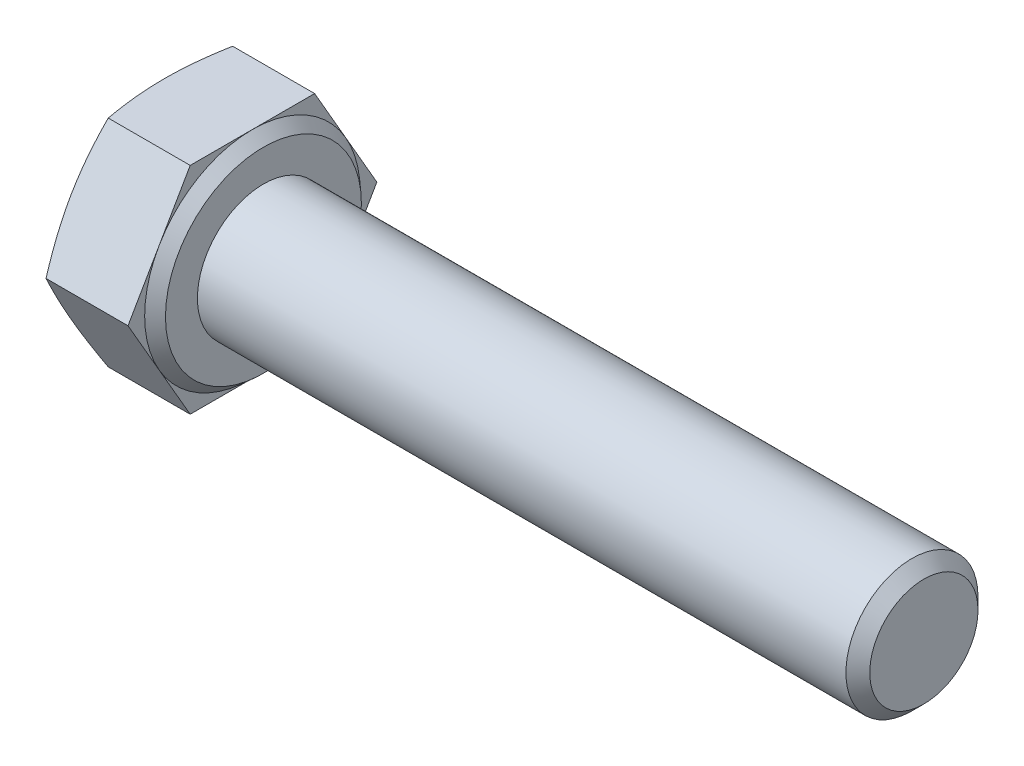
ISO-10303-21;
HEADER;
FILE_DESCRIPTION(('STEP AP214'),'2;1');
FILE_NAME('part.step','',(''),(''),'','','');
FILE_SCHEMA(('AUTOMOTIVE_DESIGN { 1 0 10303 214 1 1 1 1 }'));
ENDSEC;
DATA;
#1=APPLICATION_CONTEXT('core data for automotive mechanical design processes');
#2=APPLICATION_PROTOCOL_DEFINITION('international standard','automotive_design',2000,#1);
#3=PRODUCT_CONTEXT('',#1,'mechanical');
#4=PRODUCT('Part','Part','',(#3));
#5=PRODUCT_RELATED_PRODUCT_CATEGORY('part','',(#4));
#6=PRODUCT_DEFINITION_FORMATION('','',#4);
#7=PRODUCT_DEFINITION_CONTEXT('part definition',#1,'design');
#8=PRODUCT_DEFINITION('design','',#6,#7);
#9=PRODUCT_DEFINITION_SHAPE('','',#8);
#10=(LENGTH_UNIT() NAMED_UNIT(*) SI_UNIT(.MILLI.,.METRE.));
#11=(NAMED_UNIT(*) PLANE_ANGLE_UNIT() SI_UNIT($,.RADIAN.));
#12=(NAMED_UNIT(*) SI_UNIT($,.STERADIAN.) SOLID_ANGLE_UNIT());
#13=UNCERTAINTY_MEASURE_WITH_UNIT(LENGTH_MEASURE(1.E-05),#10,'distance_accuracy_value','');
#14=(GEOMETRIC_REPRESENTATION_CONTEXT(3) GLOBAL_UNCERTAINTY_ASSIGNED_CONTEXT((#13)) GLOBAL_UNIT_ASSIGNED_CONTEXT((#10,
#11,#12)) REPRESENTATION_CONTEXT('',''));
#15=CARTESIAN_POINT('',(0.,0.,0.));
#16=DIRECTION('',(0.,0.,1.));
#17=DIRECTION('',(1.,0.,0.));
#18=AXIS2_PLACEMENT_3D('',#15,#16,#17);
#19=CARTESIAN_POINT('',(4.5,0.,0.));
#20=DIRECTION('',(1.,0.,0.));
#21=DIRECTION('',(0.,0.,-1.));
#22=AXIS2_PLACEMENT_3D('',#19,#20,#21);
#23=PLANE('',#22);
#24=CARTESIAN_POINT('',(4.5,0.,0.));
#25=DIRECTION('',(-1.,0.,0.));
#26=DIRECTION('',(0.,0.,1.));
#27=AXIS2_PLACEMENT_3D('',#24,#25,#26);
#28=CIRCLE('',#27,4.45);
#29=CARTESIAN_POINT('',(4.5,0.,4.45));
#30=VERTEX_POINT('',#29);
#31=EDGE_CURVE('E149',#30,#30,#28,.T.);
#32=ORIENTED_EDGE('',*,*,#31,.F.);
#33=EDGE_LOOP('',(#32));
#34=FACE_BOUND('',#33,.T.);
#35=CARTESIAN_POINT('',(4.5,0.,0.));
#36=DIRECTION('',(1.,0.,0.));
#37=DIRECTION('',(0.,0.,-1.));
#38=AXIS2_PLACEMENT_3D('',#35,#36,#37);
#39=CIRCLE('',#38,3.);
#40=CARTESIAN_POINT('',(4.5,0.,-3.));
#41=VERTEX_POINT('',#40);
#42=EDGE_CURVE('E150',#41,#41,#39,.T.);
#43=ORIENTED_EDGE('',*,*,#42,.F.);
#44=EDGE_LOOP('',(#43));
#45=FACE_BOUND('',#44,.T.);
#46=ADVANCED_FACE('F43',(#34,#45),#23,.T.);
#47=CARTESIAN_POINT('',(4.,0.,-5.65225913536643));
#48=DIRECTION('',(1.,0.,0.));
#49=DIRECTION('',(0.,0.,-1.));
#50=AXIS2_PLACEMENT_3D('',#47,#48,#49);
#51=PLANE('',#50);
#52=DIRECTION('',(0.,-0.866025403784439,0.5));
#53=VECTOR('',#52,1.);
#54=CARTESIAN_POINT('',(4.,4.895,2.82612956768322));
#55=LINE('',#54,#53);
#56=CARTESIAN_POINT('',(4.,4.895,2.82612956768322));
#57=VERTEX_POINT('',#56);
#58=CARTESIAN_POINT('',(4.,2.4475,4.23919435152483));
#59=VERTEX_POINT('',#58);
#60=EDGE_CURVE('E147',#57,#59,#55,.T.);
#61=ORIENTED_EDGE('',*,*,#60,.T.);
#62=CARTESIAN_POINT('',(4.,0.,0.));
#63=DIRECTION('',(-1.,0.,0.));
#64=DIRECTION('',(0.,0.,1.));
#65=AXIS2_PLACEMENT_3D('',#62,#63,#64);
#66=CIRCLE('',#65,4.89499999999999);
#67=CARTESIAN_POINT('',(4.,4.89499999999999,0.));
#68=VERTEX_POINT('',#67);
#69=EDGE_CURVE('E59',#59,#68,#66,.T.);
#70=ORIENTED_EDGE('',*,*,#69,.T.);
#71=DIRECTION('',(0.,0.,1.));
#72=VECTOR('',#71,1.);
#73=CARTESIAN_POINT('',(4.,4.895,-2.82612956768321));
#74=LINE('',#73,#72);
#75=EDGE_CURVE('E141',#68,#57,#74,.T.);
#76=ORIENTED_EDGE('',*,*,#75,.T.);
#77=EDGE_LOOP('',(#61,#70,#76));
#78=FACE_BOUND('',#77,.T.);
#79=ADVANCED_FACE('F145',(#78),#51,.T.);
#80=CARTESIAN_POINT('',(4.,4.895,-2.82612956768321));
#81=VERTEX_POINT('',#80);
#82=EDGE_CURVE('E153',#81,#68,#74,.T.);
#83=ORIENTED_EDGE('',*,*,#82,.T.);
#84=CARTESIAN_POINT('',(4.,2.4475,-4.23919435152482));
#85=VERTEX_POINT('',#84);
#86=EDGE_CURVE('E134',#68,#85,#66,.T.);
#87=ORIENTED_EDGE('',*,*,#86,.T.);
#88=DIRECTION('',(0.,0.866025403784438,0.500000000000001));
#89=VECTOR('',#88,1.);
#90=CARTESIAN_POINT('',(4.,0.,-5.65225913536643));
#91=LINE('',#90,#89);
#92=EDGE_CURVE('E157',#85,#81,#91,.T.);
#93=ORIENTED_EDGE('',*,*,#92,.T.);
#94=EDGE_LOOP('',(#83,#87,#93));
#95=FACE_BOUND('',#94,.T.);
#96=ADVANCED_FACE('F158',(#95),#51,.T.);
#97=CARTESIAN_POINT('',(4.,0.,-5.65225913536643));
#98=VERTEX_POINT('',#97);
#99=EDGE_CURVE('E156',#98,#85,#91,.T.);
#100=ORIENTED_EDGE('',*,*,#99,.T.);
#101=CARTESIAN_POINT('',(4.,-2.4475,-4.23919435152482));
#102=VERTEX_POINT('',#101);
#103=EDGE_CURVE('E133',#85,#102,#66,.T.);
#104=ORIENTED_EDGE('',*,*,#103,.T.);
#105=DIRECTION('',(0.,0.866025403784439,-0.5));
#106=VECTOR('',#105,1.);
#107=CARTESIAN_POINT('',(4.,-4.89499999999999,-2.82612956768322));
#108=LINE('',#107,#106);
#109=EDGE_CURVE('E306',#102,#98,#108,.T.);
#110=ORIENTED_EDGE('',*,*,#109,.T.);
#111=EDGE_LOOP('',(#100,#104,#110));
#112=FACE_BOUND('',#111,.T.);
#113=ADVANCED_FACE('F474',(#112),#51,.T.);
#114=CARTESIAN_POINT('',(4.,-4.89499999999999,-2.82612956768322));
#115=VERTEX_POINT('',#114);
#116=EDGE_CURVE('E302',#115,#102,#108,.T.);
#117=ORIENTED_EDGE('',*,*,#116,.T.);
#118=CARTESIAN_POINT('',(4.,-4.89499999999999,0.));
#119=VERTEX_POINT('',#118);
#120=EDGE_CURVE('E373',#102,#119,#66,.T.);
#121=ORIENTED_EDGE('',*,*,#120,.T.);
#122=DIRECTION('',(0.,0.,-1.));
#123=VECTOR('',#122,1.);
#124=CARTESIAN_POINT('',(4.,-4.895,2.82612956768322));
#125=LINE('',#124,#123);
#126=EDGE_CURVE('E171',#119,#115,#125,.T.);
#127=ORIENTED_EDGE('',*,*,#126,.T.);
#128=EDGE_LOOP('',(#117,#121,#127));
#129=FACE_BOUND('',#128,.T.);
#130=ADVANCED_FACE('F465',(#129),#51,.T.);
#131=CARTESIAN_POINT('',(4.,-4.895,2.82612956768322));
#132=VERTEX_POINT('',#131);
#133=EDGE_CURVE('E175',#132,#119,#125,.T.);
#134=ORIENTED_EDGE('',*,*,#133,.T.);
#135=CARTESIAN_POINT('',(4.,-2.4475,4.23919435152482));
#136=VERTEX_POINT('',#135);
#137=EDGE_CURVE('E375',#119,#136,#66,.T.);
#138=ORIENTED_EDGE('',*,*,#137,.T.);
#139=DIRECTION('',(0.,-0.866025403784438,-0.5));
#140=VECTOR('',#139,1.);
#141=CARTESIAN_POINT('',(4.,0.,5.65225913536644));
#142=LINE('',#141,#140);
#143=EDGE_CURVE('E170',#136,#132,#142,.T.);
#144=ORIENTED_EDGE('',*,*,#143,.T.);
#145=EDGE_LOOP('',(#134,#138,#144));
#146=FACE_BOUND('',#145,.T.);
#147=ADVANCED_FACE('F290',(#146),#51,.T.);
#148=CARTESIAN_POINT('',(4.,0.,5.65225913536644));
#149=VERTEX_POINT('',#148);
#150=EDGE_CURVE('E166',#149,#136,#142,.T.);
#151=ORIENTED_EDGE('',*,*,#150,.T.);
#152=EDGE_CURVE('E146',#136,#59,#66,.T.);
#153=ORIENTED_EDGE('',*,*,#152,.T.);
#154=EDGE_CURVE('E162',#59,#149,#55,.T.);
#155=ORIENTED_EDGE('',*,*,#154,.T.);
#156=EDGE_LOOP('',(#151,#153,#155));
#157=FACE_BOUND('',#156,.T.);
#158=ADVANCED_FACE('F213',(#157),#51,.T.);
#159=CARTESIAN_POINT('',(4.,-4.89499999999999,-2.82612956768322));
#160=DIRECTION('',(0.,0.5,0.866025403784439));
#161=DIRECTION('',(0.,-0.866025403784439,0.5));
#162=AXIS2_PLACEMENT_3D('',#159,#160,#161);
#163=PLANE('',#162);
#164=CARTESIAN_POINT('',(0.275661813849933,0.000199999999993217,-5.65237460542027));
#165=CARTESIAN_POINT('',(0.233044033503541,-0.202529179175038,-5.53532885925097));
#166=CARTESIAN_POINT('',(0.194275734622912,-0.405926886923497,-5.41789713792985));
#167=CARTESIAN_POINT('',(0.126068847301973,-0.814044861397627,-5.18227011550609));
#168=CARTESIAN_POINT('',(0.0966375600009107,-1.01876603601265,-5.06407429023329));
#169=CARTESIAN_POINT('',(0.0490332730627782,-1.4272589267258,-4.828230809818));
#170=CARTESIAN_POINT('',(0.0307564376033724,-1.63102131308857,-4.71058854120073));
#171=CARTESIAN_POINT('',(0.00624205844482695,-2.03902260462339,-4.47502888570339));
#172=CARTESIAN_POINT('',(0.,-2.2432613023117,-4.35711161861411));
#173=CARTESIAN_POINT('',(0.,-2.6517386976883,-4.12127708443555));
#174=CARTESIAN_POINT('',(0.00624205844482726,-2.85597739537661,-4.00335981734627));
#175=CARTESIAN_POINT('',(0.0307564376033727,-3.26397868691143,-3.76780016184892));
#176=CARTESIAN_POINT('',(0.0490332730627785,-3.4677410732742,-3.65015789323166));
#177=CARTESIAN_POINT('',(0.0966375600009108,-3.87623396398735,-3.41431441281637));
#178=CARTESIAN_POINT('',(0.126068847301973,-4.08095513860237,-3.29611858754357));
#179=CARTESIAN_POINT('',(0.194275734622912,-4.4890731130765,-3.06049156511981));
#180=CARTESIAN_POINT('',(0.233044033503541,-4.69247082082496,-2.94305984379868));
#181=CARTESIAN_POINT('',(0.275661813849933,-4.89519999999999,-2.82601409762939));
#182=B_SPLINE_CURVE_WITH_KNOTS('',3,(#164,#165,#166,#167,#168,#169,#170,#171,#172,#173,#174,
#175,#176,#177,#178,#179,#180,#181),.UNSPECIFIED.,.F.,.F.,(4,2,2,2,2,2,2,2,4),(0.,
0.713891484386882,1.42833983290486,2.13603175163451,2.84345813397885,3.55088451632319,
4.25857643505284,4.97302478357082,5.6869162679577),.UNSPECIFIED.);
#183=CARTESIAN_POINT('',(0.275619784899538,0.,-5.65225913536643));
#184=VERTEX_POINT('',#183);
#185=CARTESIAN_POINT('',(0.,-2.4475,-4.23919435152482));
#186=VERTEX_POINT('',#185);
#187=EDGE_CURVE('E295',#184,#186,#182,.T.);
#188=ORIENTED_EDGE('',*,*,#187,.F.);
#189=DIRECTION('',(-1.,0.,0.));
#190=VECTOR('',#189,1.);
#191=CARTESIAN_POINT('',(4.,0.,-5.65225913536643));
#192=LINE('',#191,#190);
#193=EDGE_CURVE('E190',#98,#184,#192,.T.);
#194=ORIENTED_EDGE('',*,*,#193,.F.);
#195=ORIENTED_EDGE('',*,*,#109,.F.);
#196=ORIENTED_EDGE('',*,*,#116,.F.);
#197=DIRECTION('',(-1.,0.,0.));
#198=VECTOR('',#197,1.);
#199=CARTESIAN_POINT('',(4.,-4.89499999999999,-2.82612956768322));
#200=LINE('',#199,#198);
#201=CARTESIAN_POINT('',(0.275619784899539,-4.89499999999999,-2.82612956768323));
#202=VERTEX_POINT('',#201);
#203=EDGE_CURVE('E174',#115,#202,#200,.T.);
#204=ORIENTED_EDGE('',*,*,#203,.T.);
#205=EDGE_CURVE('E249',#186,#202,#182,.T.);
#206=ORIENTED_EDGE('',*,*,#205,.F.);
#207=EDGE_LOOP('',(#188,#194,#195,#196,#204,#206));
#208=FACE_BOUND('',#207,.T.);
#209=ADVANCED_FACE('F276',(#208),#163,.F.);
#210=CARTESIAN_POINT('',(4.,0.,-5.65225913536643));
#211=DIRECTION('',(0.,-0.500000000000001,0.866025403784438));
#212=DIRECTION('',(0.,-0.866025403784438,-0.500000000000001));
#213=AXIS2_PLACEMENT_3D('',#210,#211,#212);
#214=PLANE('',#213);
#215=CARTESIAN_POINT('',(0.275661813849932,4.8952,-2.82601409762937));
#216=CARTESIAN_POINT('',(0.23304403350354,4.69247082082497,-2.94305984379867));
#217=CARTESIAN_POINT('',(0.19427573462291,4.48907311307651,-3.06049156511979));
#218=CARTESIAN_POINT('',(0.126068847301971,4.08095513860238,-3.29611858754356));
#219=CARTESIAN_POINT('',(0.096637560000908,3.87623396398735,-3.41431441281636));
#220=CARTESIAN_POINT('',(0.0490332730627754,3.4677410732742,-3.65015789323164));
#221=CARTESIAN_POINT('',(0.0307564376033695,3.26397868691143,-3.76780016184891));
#222=CARTESIAN_POINT('',(0.00624205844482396,2.85597739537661,-4.00335981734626));
#223=CARTESIAN_POINT('',(0.,2.6517386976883,-4.12127708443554));
#224=CARTESIAN_POINT('',(0.,2.24326130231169,-4.3571116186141));
#225=CARTESIAN_POINT('',(0.00624205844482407,2.03902260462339,-4.47502888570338));
#226=CARTESIAN_POINT('',(0.0307564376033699,1.63102131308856,-4.71058854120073));
#227=CARTESIAN_POINT('',(0.0490332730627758,1.42725892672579,-4.828230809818));
#228=CARTESIAN_POINT('',(0.0966375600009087,1.01876603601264,-5.06407429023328));
#229=CARTESIAN_POINT('',(0.126068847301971,0.814044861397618,-5.18227011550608));
#230=CARTESIAN_POINT('',(0.194275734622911,0.405926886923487,-5.41789713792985));
#231=CARTESIAN_POINT('',(0.233044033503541,0.202529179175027,-5.53532885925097));
#232=CARTESIAN_POINT('',(0.275661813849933,-0.000200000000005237,-5.65237460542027));
#233=B_SPLINE_CURVE_WITH_KNOTS('',3,(#215,#216,#217,#218,#219,#220,#221,#222,#223,#224,#225,
#226,#227,#228,#229,#230,#231,#232),.UNSPECIFIED.,.F.,.F.,(4,2,2,2,2,2,2,2,4),(0.,
0.713891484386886,1.42833983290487,2.13603175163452,2.84345813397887,3.55088451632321,
4.25857643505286,4.97302478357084,5.68691626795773),.UNSPECIFIED.);
#234=CARTESIAN_POINT('',(0.275619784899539,4.895,-2.82612956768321));
#235=VERTEX_POINT('',#234);
#236=CARTESIAN_POINT('',(0.,2.4475,-4.23919435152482));
#237=VERTEX_POINT('',#236);
#238=EDGE_CURVE('E268',#235,#237,#233,.T.);
#239=ORIENTED_EDGE('',*,*,#238,.F.);
#240=DIRECTION('',(-1.,0.,0.));
#241=VECTOR('',#240,1.);
#242=CARTESIAN_POINT('',(4.,4.895,-2.82612956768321));
#243=LINE('',#242,#241);
#244=EDGE_CURVE('E184',#81,#235,#243,.T.);
#245=ORIENTED_EDGE('',*,*,#244,.F.);
#246=ORIENTED_EDGE('',*,*,#92,.F.);
#247=ORIENTED_EDGE('',*,*,#99,.F.);
#248=ORIENTED_EDGE('',*,*,#193,.T.);
#249=EDGE_CURVE('E265',#237,#184,#233,.T.);
#250=ORIENTED_EDGE('',*,*,#249,.F.);
#251=EDGE_LOOP('',(#239,#245,#246,#247,#248,#250));
#252=FACE_BOUND('',#251,.T.);
#253=ADVANCED_FACE('F277',(#252),#214,.F.);
#254=CARTESIAN_POINT('',(4.,4.895,-2.82612956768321));
#255=DIRECTION('',(0.,-1.,0.));
#256=DIRECTION('',(0.,0.,-1.));
#257=AXIS2_PLACEMENT_3D('',#254,#255,#256);
#258=PLANE('',#257);
#259=CARTESIAN_POINT('',(1.47280282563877,4.895,-7.48259735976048));
#260=CARTESIAN_POINT('',(1.4053660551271,4.895,-7.26112985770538));
#261=CARTESIAN_POINT('',(1.33871618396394,4.895,-7.03941829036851));
#262=CARTESIAN_POINT('',(1.20742555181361,4.895,-6.59538277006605));
#263=CARTESIAN_POINT('',(1.14278494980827,4.895,-6.37305877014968));
#264=CARTESIAN_POINT('',(1.01584063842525,4.895,-5.9272935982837));
#265=CARTESIAN_POINT('',(0.953541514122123,4.895,-5.70385111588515));
#266=CARTESIAN_POINT('',(0.832009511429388,4.895,-5.25613497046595));
#267=CARTESIAN_POINT('',(0.772776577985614,4.895,-5.03186132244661));
#268=CARTESIAN_POINT('',(0.658841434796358,4.895,-4.58509839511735));
#269=CARTESIAN_POINT('',(0.604092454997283,4.895,-4.36262110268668));
#270=CARTESIAN_POINT('',(0.499258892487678,4.895,-3.91657221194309));
#271=CARTESIAN_POINT('',(0.449174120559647,4.895,-3.69300065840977));
#272=CARTESIAN_POINT('',(0.354831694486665,4.895,-3.24469411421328));
#273=CARTESIAN_POINT('',(0.310572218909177,4.895,-3.01995951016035));
#274=CARTESIAN_POINT('',(0.229229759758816,4.895,-2.56918556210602));
#275=CARTESIAN_POINT('',(0.192146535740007,4.895,-2.34314626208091));
#276=CARTESIAN_POINT('',(0.130334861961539,4.895,-1.91521583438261));
#277=CARTESIAN_POINT('',(0.104687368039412,4.895,-1.71345870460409));
#278=CARTESIAN_POINT('',(0.0612722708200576,4.895,-1.30909131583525));
#279=CARTESIAN_POINT('',(0.0435044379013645,4.895,-1.10648108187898));
#280=CARTESIAN_POINT('',(0.0167043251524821,4.895,-0.700818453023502));
#281=CARTESIAN_POINT('',(0.00766586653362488,4.895,-0.497766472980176));
#282=CARTESIAN_POINT('',(-0.00121788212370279,4.895,-0.0914593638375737));
#283=CARTESIAN_POINT('',(-0.00106323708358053,4.895,0.111795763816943));
#284=CARTESIAN_POINT('',(0.00845489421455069,4.895,0.519118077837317));
#285=CARTESIAN_POINT('',(0.0178650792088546,4.895,0.723184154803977));
#286=CARTESIAN_POINT('',(0.0454612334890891,4.895,1.13071691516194));
#287=CARTESIAN_POINT('',(0.0636474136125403,4.895,1.33418358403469));
#288=CARTESIAN_POINT('',(0.107944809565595,4.895,1.74041706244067));
#289=CARTESIAN_POINT('',(0.134062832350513,4.895,1.94318311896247));
#290=CARTESIAN_POINT('',(0.193164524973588,4.895,2.34770083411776));
#291=CARTESIAN_POINT('',(0.226148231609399,4.895,2.54945248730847));
#292=CARTESIAN_POINT('',(0.299805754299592,4.895,2.96255825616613));
#293=CARTESIAN_POINT('',(0.340794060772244,4.895,3.17385579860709));
#294=CARTESIAN_POINT('',(0.428046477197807,4.895,3.59536569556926));
#295=CARTESIAN_POINT('',(0.474310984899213,4.895,3.80557796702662));
#296=CARTESIAN_POINT('',(0.571141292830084,4.895,4.22506166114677));
#297=CARTESIAN_POINT('',(0.621708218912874,4.895,4.43433282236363));
#298=CARTESIAN_POINT('',(0.726331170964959,4.895,4.85200390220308));
#299=CARTESIAN_POINT('',(0.780387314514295,4.895,5.06040379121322));
#300=CARTESIAN_POINT('',(0.946912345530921,4.895,5.68499348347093));
#301=CARTESIAN_POINT('',(1.06361407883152,4.895,6.10005298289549));
#302=CARTESIAN_POINT('',(1.3045083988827,4.895,6.92789191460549));
#303=CARTESIAN_POINT('',(1.42869979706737,4.895,7.34067169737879));
#304=CARTESIAN_POINT('',(1.68088123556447,4.895,8.16007873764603));
#305=CARTESIAN_POINT('',(1.80881421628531,4.895,8.5667236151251));
#306=CARTESIAN_POINT('',(2.06831294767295,4.895,9.37886971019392));
#307=CARTESIAN_POINT('',(2.19987887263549,4.895,9.78437087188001));
#308=CARTESIAN_POINT('',(2.46515556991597,4.895,10.5929650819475));
#309=CARTESIAN_POINT('',(2.59885630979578,4.895,10.9960614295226));
#310=CARTESIAN_POINT('',(2.86826241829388,4.895,11.8015473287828));
#311=CARTESIAN_POINT('',(3.00396762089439,4.895,12.2039369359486));
#312=CARTESIAN_POINT('',(3.14037395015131,4.895,12.6060852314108));
#313=B_SPLINE_CURVE_WITH_KNOTS('',3,(#259,#260,#261,#262,#263,#264,#265,#266,#267,#268,#269,
#270,#271,#272,#273,#274,#275,#276,#277,#278,#279,#280,#281,#282,#283,#284,#285,#286,#287,#288,
#289,#290,#291,#292,#293,#294,#295,#296,#297,#298,#299,#300,#301,#302,#303,#304,#305,#306,#307,
#308,#309,#310,#311,#312),.UNSPECIFIED.,.F.,.F.,(4,2,2,2,2,2,2,2,2,2,2,2,2,2,2,2,2,2,2,2,2,2,2,
2,2,2,4),(0.,0.69452644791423,1.38910771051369,2.08498488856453,2.78084956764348,
3.46815431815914,4.15543117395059,4.84249262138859,5.52953104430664,6.1395393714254,
6.74952992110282,7.35908839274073,7.96864255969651,8.58128808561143,9.19394833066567,
9.8071358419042,10.4203266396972,11.0659531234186,11.7116283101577,12.3574729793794,
13.0033394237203,14.2966762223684,15.5898083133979,16.8686670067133,18.1475871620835,
19.4216546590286,20.6956172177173),.UNSPECIFIED.);
#314=CARTESIAN_POINT('',(0.275619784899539,4.895,2.82612956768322));
#315=VERTEX_POINT('',#314);
#316=CARTESIAN_POINT('',(0.,4.895,0.));
#317=VERTEX_POINT('',#316);
#318=EDGE_CURVE('E69',#315,#317,#313,.F.);
#319=ORIENTED_EDGE('',*,*,#318,.F.);
#320=DIRECTION('',(-1.,0.,0.));
#321=VECTOR('',#320,1.);
#322=CARTESIAN_POINT('',(4.,4.895,2.82612956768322));
#323=LINE('',#322,#321);
#324=EDGE_CURVE('E159',#57,#315,#323,.T.);
#325=ORIENTED_EDGE('',*,*,#324,.F.);
#326=ORIENTED_EDGE('',*,*,#75,.F.);
#327=ORIENTED_EDGE('',*,*,#82,.F.);
#328=ORIENTED_EDGE('',*,*,#244,.T.);
#329=EDGE_CURVE('E267',#317,#235,#313,.F.);
#330=ORIENTED_EDGE('',*,*,#329,.F.);
#331=EDGE_LOOP('',(#319,#325,#326,#327,#328,#330));
#332=FACE_BOUND('',#331,.T.);
#333=ADVANCED_FACE('F151',(#332),#258,.F.);
#334=CARTESIAN_POINT('',(4.,4.895,2.82612956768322));
#335=DIRECTION('',(0.,-0.5,-0.866025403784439));
#336=DIRECTION('',(0.,0.866025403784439,-0.5));
#337=AXIS2_PLACEMENT_3D('',#334,#335,#336);
#338=PLANE('',#337);
#339=CARTESIAN_POINT('',(0.275661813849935,-0.000199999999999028,5.65237460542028));
#340=CARTESIAN_POINT('',(0.233044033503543,0.202529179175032,5.53532885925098));
#341=CARTESIAN_POINT('',(0.194275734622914,0.405926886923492,5.41789713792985));
#342=CARTESIAN_POINT('',(0.126068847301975,0.814044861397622,5.18227011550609));
#343=CARTESIAN_POINT('',(0.0966375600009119,1.01876603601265,5.06407429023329));
#344=CARTESIAN_POINT('',(0.0490332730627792,1.42725892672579,4.828230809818));
#345=CARTESIAN_POINT('',(0.0307564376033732,1.63102131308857,4.71058854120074));
#346=CARTESIAN_POINT('',(0.00624205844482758,2.03902260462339,4.47502888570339));
#347=CARTESIAN_POINT('',(0.,2.24326130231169,4.35711161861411));
#348=CARTESIAN_POINT('',(0.,2.6517386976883,4.12127708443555));
#349=CARTESIAN_POINT('',(0.00624205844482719,2.85597739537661,4.00335981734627));
#350=CARTESIAN_POINT('',(0.0307564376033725,3.26397868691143,3.76780016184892));
#351=CARTESIAN_POINT('',(0.0490332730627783,3.4677410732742,3.65015789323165));
#352=CARTESIAN_POINT('',(0.0966375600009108,3.87623396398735,3.41431441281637));
#353=CARTESIAN_POINT('',(0.126068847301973,4.08095513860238,3.29611858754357));
#354=CARTESIAN_POINT('',(0.194275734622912,4.4890731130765,3.06049156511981));
#355=CARTESIAN_POINT('',(0.233044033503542,4.69247082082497,2.94305984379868));
#356=CARTESIAN_POINT('',(0.275661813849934,4.8952,2.82601409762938));
#357=B_SPLINE_CURVE_WITH_KNOTS('',3,(#339,#340,#341,#342,#343,#344,#345,#346,#347,#348,#349,
#350,#351,#352,#353,#354,#355,#356),.UNSPECIFIED.,.F.,.F.,(4,2,2,2,2,2,2,2,4),(0.,
0.713891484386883,1.42833983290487,2.13603175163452,2.84345813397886,3.5508845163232,
4.25857643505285,4.97302478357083,5.68691626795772),.UNSPECIFIED.);
#358=CARTESIAN_POINT('',(0.27561978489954,0.,5.65225913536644));
#359=VERTEX_POINT('',#358);
#360=CARTESIAN_POINT('',(0.,2.4475,4.23919435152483));
#361=VERTEX_POINT('',#360);
#362=EDGE_CURVE('E257',#359,#361,#357,.T.);
#363=ORIENTED_EDGE('',*,*,#362,.F.);
#364=DIRECTION('',(-1.,0.,0.));
#365=VECTOR('',#364,1.);
#366=CARTESIAN_POINT('',(4.,0.,5.65225913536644));
#367=LINE('',#366,#365);
#368=EDGE_CURVE('E181',#149,#359,#367,.T.);
#369=ORIENTED_EDGE('',*,*,#368,.F.);
#370=ORIENTED_EDGE('',*,*,#154,.F.);
#371=ORIENTED_EDGE('',*,*,#60,.F.);
#372=ORIENTED_EDGE('',*,*,#324,.T.);
#373=EDGE_CURVE('E309',#361,#315,#357,.T.);
#374=ORIENTED_EDGE('',*,*,#373,.F.);
#375=EDGE_LOOP('',(#363,#369,#370,#371,#372,#374));
#376=FACE_BOUND('',#375,.T.);
#377=ADVANCED_FACE('F356',(#376),#338,.F.);
#378=CARTESIAN_POINT('',(4.,0.,5.65225913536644));
#379=DIRECTION('',(0.,0.5,-0.866025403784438));
#380=DIRECTION('',(0.,0.866025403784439,0.5));
#381=AXIS2_PLACEMENT_3D('',#378,#379,#380);
#382=PLANE('',#381);
#383=CARTESIAN_POINT('',(0.275661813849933,-4.8952,2.82601409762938));
#384=CARTESIAN_POINT('',(0.233044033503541,-4.69247082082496,2.94305984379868));
#385=CARTESIAN_POINT('',(0.194275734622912,-4.4890731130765,3.0604915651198));
#386=CARTESIAN_POINT('',(0.126068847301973,-4.08095513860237,3.29611858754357));
#387=CARTESIAN_POINT('',(0.0966375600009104,-3.87623396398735,3.41431441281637));
#388=CARTESIAN_POINT('',(0.049033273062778,-3.4677410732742,3.65015789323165));
#389=CARTESIAN_POINT('',(0.0307564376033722,-3.26397868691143,3.76780016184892));
#390=CARTESIAN_POINT('',(0.00624205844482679,-2.8559773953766,4.00335981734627));
#391=CARTESIAN_POINT('',(0.,-2.6517386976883,4.12127708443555));
#392=CARTESIAN_POINT('',(0.,-2.24326130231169,4.35711161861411));
#393=CARTESIAN_POINT('',(0.00624205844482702,-2.03902260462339,4.47502888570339));
#394=CARTESIAN_POINT('',(0.0307564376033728,-1.63102131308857,4.71058854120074));
#395=CARTESIAN_POINT('',(0.0490332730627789,-1.42725892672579,4.828230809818));
#396=CARTESIAN_POINT('',(0.0966375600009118,-1.01876603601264,5.06407429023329));
#397=CARTESIAN_POINT('',(0.126068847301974,-0.814044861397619,5.18227011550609));
#398=CARTESIAN_POINT('',(0.194275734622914,-0.405926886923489,5.41789713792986));
#399=CARTESIAN_POINT('',(0.233044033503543,-0.20252917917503,5.53532885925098));
#400=CARTESIAN_POINT('',(0.275661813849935,0.000200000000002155,5.65237460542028));
#401=B_SPLINE_CURVE_WITH_KNOTS('',3,(#383,#384,#385,#386,#387,#388,#389,#390,#391,#392,#393,
#394,#395,#396,#397,#398,#399,#400),.UNSPECIFIED.,.F.,.F.,(4,2,2,2,2,2,2,2,4),(0.,
0.713891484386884,1.42833983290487,2.13603175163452,2.84345813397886,3.5508845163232,
4.25857643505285,4.97302478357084,5.68691626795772),.UNSPECIFIED.);
#402=CARTESIAN_POINT('',(0.275619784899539,-4.895,2.82612956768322));
#403=VERTEX_POINT('',#402);
#404=CARTESIAN_POINT('',(0.,-2.4475,4.23919435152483));
#405=VERTEX_POINT('',#404);
#406=EDGE_CURVE('E245',#403,#405,#401,.T.);
#407=ORIENTED_EDGE('',*,*,#406,.F.);
#408=DIRECTION('',(-1.,0.,0.));
#409=VECTOR('',#408,1.);
#410=CARTESIAN_POINT('',(4.,-4.895,2.82612956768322));
#411=LINE('',#410,#409);
#412=EDGE_CURVE('E178',#132,#403,#411,.T.);
#413=ORIENTED_EDGE('',*,*,#412,.F.);
#414=ORIENTED_EDGE('',*,*,#143,.F.);
#415=ORIENTED_EDGE('',*,*,#150,.F.);
#416=ORIENTED_EDGE('',*,*,#368,.T.);
#417=EDGE_CURVE('E296',#405,#359,#401,.T.);
#418=ORIENTED_EDGE('',*,*,#417,.F.);
#419=EDGE_LOOP('',(#407,#413,#414,#415,#416,#418));
#420=FACE_BOUND('',#419,.T.);
#421=ADVANCED_FACE('F353',(#420),#382,.F.);
#422=CARTESIAN_POINT('',(4.,-4.895,2.82612956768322));
#423=DIRECTION('',(0.,1.,0.));
#424=DIRECTION('',(0.,0.,1.));
#425=AXIS2_PLACEMENT_3D('',#422,#423,#424);
#426=PLANE('',#425);
#427=CARTESIAN_POINT('',(1.47280309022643,-4.89499999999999,-7.48259822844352));
#428=CARTESIAN_POINT('',(1.40536630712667,-4.89499999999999,-7.26113069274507));
#429=CARTESIAN_POINT('',(1.33871642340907,-4.89499999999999,-7.03941909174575));
#430=CARTESIAN_POINT('',(1.2074257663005,-4.89499999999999,-6.5953835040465));
#431=CARTESIAN_POINT('',(1.14278515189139,-4.89499999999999,-6.37305947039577));
#432=CARTESIAN_POINT('',(1.01584081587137,-4.89499999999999,-5.927294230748));
#433=CARTESIAN_POINT('',(0.953541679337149,-4.89499999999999,-5.70385171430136));
#434=CARTESIAN_POINT('',(0.832009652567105,-4.89499999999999,-5.25613550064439));
#435=CARTESIAN_POINT('',(0.772776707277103,-4.89499999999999,-5.03186181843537));
#436=CARTESIAN_POINT('',(0.658841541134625,-4.89499999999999,-4.58509882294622));
#437=CARTESIAN_POINT('',(0.604092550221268,-4.89499999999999,-4.36262149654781));
#438=CARTESIAN_POINT('',(0.499258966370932,-4.89499999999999,-3.91657253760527));
#439=CARTESIAN_POINT('',(0.449174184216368,-4.89499999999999,-3.69300094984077));
#440=CARTESIAN_POINT('',(0.354831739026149,-4.89499999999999,-3.24469433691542));
#441=CARTESIAN_POINT('',(0.310572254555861,-4.89499999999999,-3.01995969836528));
#442=CARTESIAN_POINT('',(0.229229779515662,-4.89499999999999,-2.56918568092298));
#443=CARTESIAN_POINT('',(0.19214654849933,-4.89499999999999,-2.34314634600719));
#444=CARTESIAN_POINT('',(0.130334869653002,-4.89499999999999,-1.91521589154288));
#445=CARTESIAN_POINT('',(0.104687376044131,-4.89499999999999,-1.71345877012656));
#446=CARTESIAN_POINT('',(0.0612722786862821,-4.89499999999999,-1.30909139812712));
#447=CARTESIAN_POINT('',(0.0435044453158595,-4.89499999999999,-1.10648117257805));
#448=CARTESIAN_POINT('',(0.016704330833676,-4.89499999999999,-0.700818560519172));
#449=CARTESIAN_POINT('',(0.00766587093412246,-4.895,-0.497766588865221));
#450=CARTESIAN_POINT('',(-0.00121788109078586,-4.895,-0.091459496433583));
#451=CARTESIAN_POINT('',(-0.00106323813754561,-4.895,0.111795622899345));
#452=CARTESIAN_POINT('',(0.00845488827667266,-4.895,0.519117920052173));
#453=CARTESIAN_POINT('',(0.0178650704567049,-4.895,0.723183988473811));
#454=CARTESIAN_POINT('',(0.0454612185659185,-4.895,1.13071673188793));
#455=CARTESIAN_POINT('',(0.0636473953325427,-4.895,1.33418339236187));
#456=CARTESIAN_POINT('',(0.107944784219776,-4.895,1.7404168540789));
#457=CARTESIAN_POINT('',(0.134062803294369,-4.895,1.94318290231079));
#458=CARTESIAN_POINT('',(0.193164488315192,-4.895,2.34770060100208));
#459=CARTESIAN_POINT('',(0.22614819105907,-4.895,2.5494522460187));
#460=CARTESIAN_POINT('',(0.299805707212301,-4.895,2.96255800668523));
#461=CARTESIAN_POINT('',(0.340794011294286,-4.895,3.17385554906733));
#462=CARTESIAN_POINT('',(0.428046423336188,-4.895,3.59536544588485));
#463=CARTESIAN_POINT('',(0.474310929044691,-4.895,3.80557771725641));
#464=CARTESIAN_POINT('',(0.571141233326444,-4.895,4.22506141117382));
#465=CARTESIAN_POINT('',(0.621708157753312,-4.895,4.43433257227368));
#466=CARTESIAN_POINT('',(0.726331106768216,-4.895,4.85200365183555));
#467=CARTESIAN_POINT('',(0.78038724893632,-4.895,5.06040354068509));
#468=CARTESIAN_POINT('',(0.946912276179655,-4.895,5.68499323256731));
#469=CARTESIAN_POINT('',(1.06361400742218,-4.895,6.10005273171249));
#470=CARTESIAN_POINT('',(1.30450832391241,-4.895,6.92789166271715));
#471=CARTESIAN_POINT('',(1.42869972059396,-4.895,7.34067144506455));
#472=CARTESIAN_POINT('',(1.68088115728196,-4.895,8.16007848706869));
#473=CARTESIAN_POINT('',(1.80881413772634,-4.895,8.56672336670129));
#474=CARTESIAN_POINT('',(2.06831286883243,-4.895,9.3788694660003));
#475=CARTESIAN_POINT('',(2.19987879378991,-4.895,9.78437062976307));
#476=CARTESIAN_POINT('',(2.4651554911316,-4.895,10.5929648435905));
#477=CARTESIAN_POINT('',(2.59885623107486,-4.895,10.9960611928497));
#478=CARTESIAN_POINT('',(2.86826233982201,-4.895,11.801547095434));
#479=CARTESIAN_POINT('',(3.0039675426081,-4.895,12.2039367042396));
#480=CARTESIAN_POINT('',(3.14037387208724,-4.895,12.6060850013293));
#481=B_SPLINE_CURVE_WITH_KNOTS('',3,(#427,#428,#429,#430,#431,#432,#433,#434,#435,#436,#437,
#438,#439,#440,#441,#442,#443,#444,#445,#446,#447,#448,#449,#450,#451,#452,#453,#454,#455,#456,
#457,#458,#459,#460,#461,#462,#463,#464,#465,#466,#467,#468,#469,#470,#471,#472,#473,#474,#475,
#476,#477,#478,#479,#480),.UNSPECIFIED.,.F.,.F.,(4,2,2,2,2,2,2,2,2,2,2,2,2,2,2,2,2,2,2,2,2,2,2,
2,2,2,4),(0.,0.694526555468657,1.38910792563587,2.08498521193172,2.78084999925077,
3.46815485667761,4.15543181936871,4.84249337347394,5.52953190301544,6.13954020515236,
6.7495307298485,7.35908917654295,7.96864331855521,8.5812888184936,9.19394903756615,
9.80713652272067,10.4203272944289,11.0659537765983,11.7116289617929,12.3574736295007,
13.0033400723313,14.2966768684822,15.5898089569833,16.8686676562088,18.1475878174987,
19.4216553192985,20.6956178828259),.UNSPECIFIED.);
#482=CARTESIAN_POINT('',(0.,-4.895,0.));
#483=VERTEX_POINT('',#482);
#484=EDGE_CURVE('E319',#202,#483,#481,.T.);
#485=ORIENTED_EDGE('',*,*,#484,.F.);
#486=ORIENTED_EDGE('',*,*,#203,.F.);
#487=ORIENTED_EDGE('',*,*,#126,.F.);
#488=ORIENTED_EDGE('',*,*,#133,.F.);
#489=ORIENTED_EDGE('',*,*,#412,.T.);
#490=EDGE_CURVE('E233',#483,#403,#481,.T.);
#491=ORIENTED_EDGE('',*,*,#490,.F.);
#492=EDGE_LOOP('',(#485,#486,#487,#488,#489,#491));
#493=FACE_BOUND('',#492,.T.);
#494=ADVANCED_FACE('F351',(#493),#426,.F.);
#495=CARTESIAN_POINT('',(0.,0.,0.));
#496=DIRECTION('',(1.,0.,0.));
#497=DIRECTION('',(0.,0.,-1.));
#498=AXIS2_PLACEMENT_3D('',#495,#496,#497);
#499=CONICAL_SURFACE('',#498,4.895,1.22173047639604);
#500=ORIENTED_EDGE('',*,*,#249,.T.);
#501=ORIENTED_EDGE('',*,*,#187,.T.);
#502=CARTESIAN_POINT('',(0.,0.,0.));
#503=DIRECTION('',(1.,0.,0.));
#504=DIRECTION('',(0.,0.,-1.));
#505=AXIS2_PLACEMENT_3D('',#502,#503,#504);
#506=CIRCLE('',#505,4.895);
#507=EDGE_CURVE('E188',#186,#237,#506,.T.);
#508=ORIENTED_EDGE('',*,*,#507,.T.);
#509=EDGE_LOOP('',(#500,#501,#508));
#510=FACE_BOUND('',#509,.T.);
#511=ADVANCED_FACE('F354',(#510),#499,.T.);
#512=ORIENTED_EDGE('',*,*,#205,.T.);
#513=ORIENTED_EDGE('',*,*,#484,.T.);
#514=EDGE_CURVE('E194',#483,#186,#506,.T.);
#515=ORIENTED_EDGE('',*,*,#514,.T.);
#516=EDGE_LOOP('',(#512,#513,#515));
#517=FACE_BOUND('',#516,.T.);
#518=ADVANCED_FACE('F380',(#517),#499,.T.);
#519=ORIENTED_EDGE('',*,*,#406,.T.);
#520=EDGE_CURVE('E374',#405,#483,#506,.T.);
#521=ORIENTED_EDGE('',*,*,#520,.T.);
#522=ORIENTED_EDGE('',*,*,#490,.T.);
#523=EDGE_LOOP('',(#519,#521,#522));
#524=FACE_BOUND('',#523,.T.);
#525=ADVANCED_FACE('F228',(#524),#499,.T.);
#526=ORIENTED_EDGE('',*,*,#362,.T.);
#527=EDGE_CURVE('E372',#361,#405,#506,.T.);
#528=ORIENTED_EDGE('',*,*,#527,.T.);
#529=ORIENTED_EDGE('',*,*,#417,.T.);
#530=EDGE_LOOP('',(#526,#528,#529));
#531=FACE_BOUND('',#530,.T.);
#532=ADVANCED_FACE('F222',(#531),#499,.T.);
#533=ORIENTED_EDGE('',*,*,#318,.T.);
#534=CARTESIAN_POINT('',(0.,0.,0.));
#535=DIRECTION('',(-1.,0.,0.));
#536=DIRECTION('',(0.,0.,1.));
#537=AXIS2_PLACEMENT_3D('',#534,#535,#536);
#538=CIRCLE('',#537,4.895);
#539=EDGE_CURVE('E329',#361,#317,#538,.T.);
#540=ORIENTED_EDGE('',*,*,#539,.F.);
#541=ORIENTED_EDGE('',*,*,#373,.T.);
#542=EDGE_LOOP('',(#533,#540,#541));
#543=FACE_BOUND('',#542,.T.);
#544=ADVANCED_FACE('F224',(#543),#499,.T.);
#545=ORIENTED_EDGE('',*,*,#329,.T.);
#546=ORIENTED_EDGE('',*,*,#238,.T.);
#547=EDGE_CURVE('E195',#237,#317,#506,.T.);
#548=ORIENTED_EDGE('',*,*,#547,.T.);
#549=EDGE_LOOP('',(#545,#546,#548));
#550=FACE_BOUND('',#549,.T.);
#551=ADVANCED_FACE('F223',(#550),#499,.T.);
#552=CARTESIAN_POINT('',(0.,0.,-5.65225913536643));
#553=DIRECTION('',(1.,0.,0.));
#554=DIRECTION('',(0.,0.,-1.));
#555=AXIS2_PLACEMENT_3D('',#552,#553,#554);
#556=PLANE('',#555);
#557=ORIENTED_EDGE('',*,*,#547,.F.);
#558=ORIENTED_EDGE('',*,*,#507,.F.);
#559=ORIENTED_EDGE('',*,*,#514,.F.);
#560=ORIENTED_EDGE('',*,*,#520,.F.);
#561=ORIENTED_EDGE('',*,*,#527,.F.);
#562=ORIENTED_EDGE('',*,*,#539,.T.);
#563=EDGE_LOOP('',(#557,#558,#559,#560,#561,#562));
#564=FACE_BOUND('',#563,.T.);
#565=ADVANCED_FACE('F344',(#564),#556,.F.);
#566=CARTESIAN_POINT('',(4.,0.,0.));
#567=DIRECTION('',(-1.,0.,0.));
#568=DIRECTION('',(0.,0.,1.));
#569=AXIS2_PLACEMENT_3D('',#566,#567,#568);
#570=CONICAL_SURFACE('',#569,4.89499999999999,0.72726268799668);
#571=ORIENTED_EDGE('',*,*,#31,.T.);
#572=EDGE_LOOP('',(#571));
#573=FACE_BOUND('',#572,.T.);
#574=ORIENTED_EDGE('',*,*,#69,.F.);
#575=ORIENTED_EDGE('',*,*,#152,.F.);
#576=ORIENTED_EDGE('',*,*,#137,.F.);
#577=ORIENTED_EDGE('',*,*,#120,.F.);
#578=ORIENTED_EDGE('',*,*,#103,.F.);
#579=ORIENTED_EDGE('',*,*,#86,.F.);
#580=EDGE_LOOP('',(#574,#575,#576,#577,#578,#579));
#581=FACE_BOUND('',#580,.T.);
#582=ADVANCED_FACE('F131',(#573,#581),#570,.T.);
#583=CARTESIAN_POINT('',(34.5,0.,0.));
#584=DIRECTION('',(-1.,0.,0.));
#585=DIRECTION('',(0.,0.,1.));
#586=AXIS2_PLACEMENT_3D('',#583,#584,#585);
#587=CYLINDRICAL_SURFACE('',#586,3.);
#588=CARTESIAN_POINT('',(33.9585,0.,0.));
#589=DIRECTION('',(1.,0.,0.));
#590=DIRECTION('',(0.,0.,-1.));
#591=AXIS2_PLACEMENT_3D('',#588,#589,#590);
#592=CIRCLE('',#591,3.);
#593=CARTESIAN_POINT('',(33.9585,0.,-3.));
#594=VERTEX_POINT('',#593);
#595=EDGE_CURVE('E11',#594,#594,#592,.F.);
#596=ORIENTED_EDGE('',*,*,#595,.T.);
#597=EDGE_LOOP('',(#596));
#598=FACE_BOUND('',#597,.T.);
#599=ORIENTED_EDGE('',*,*,#42,.T.);
#600=EDGE_LOOP('',(#599));
#601=FACE_BOUND('',#600,.T.);
#602=ADVANCED_FACE('F203',(#598,#601),#587,.T.);
#603=CARTESIAN_POINT('',(34.5,0.,0.));
#604=DIRECTION('',(1.,0.,0.));
#605=DIRECTION('',(0.,0.,-1.));
#606=AXIS2_PLACEMENT_3D('',#603,#604,#605);
#607=PLANE('',#606);
#608=CARTESIAN_POINT('',(34.5,0.,0.));
#609=DIRECTION('',(1.,0.,0.));
#610=DIRECTION('',(0.,0.,-1.));
#611=AXIS2_PLACEMENT_3D('',#608,#609,#610);
#612=CIRCLE('',#611,2.4585);
#613=CARTESIAN_POINT('',(34.5,0.,-2.45850000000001));
#614=VERTEX_POINT('',#613);
#615=EDGE_CURVE('E51',#614,#614,#612,.T.);
#616=ORIENTED_EDGE('',*,*,#615,.T.);
#617=EDGE_LOOP('',(#616));
#618=FACE_BOUND('',#617,.T.);
#619=ADVANCED_FACE('F196',(#618),#607,.T.);
#620=CARTESIAN_POINT('',(34.5,0.,0.));
#621=DIRECTION('',(-1.,0.,0.));
#622=DIRECTION('',(0.,0.,1.));
#623=AXIS2_PLACEMENT_3D('',#620,#621,#622);
#624=CONICAL_SURFACE('',#623,2.4585,0.78539816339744);
#625=ORIENTED_EDGE('',*,*,#595,.F.);
#626=EDGE_LOOP('',(#625));
#627=FACE_BOUND('',#626,.T.);
#628=ORIENTED_EDGE('',*,*,#615,.F.);
#629=EDGE_LOOP('',(#628));
#630=FACE_BOUND('',#629,.T.);
#631=ADVANCED_FACE('F44',(#627,#630),#624,.T.);
#632=CLOSED_SHELL('',(#46,#79,#96,#113,#130,#147,#158,#209,#253,#333,#377,#421,#494,#511,#518,
#525,#532,#544,#551,#565,#582,#602,#619,#631));
#633=MANIFOLD_SOLID_BREP('B2',#632);
#634=ADVANCED_BREP_SHAPE_REPRESENTATION('',(#18,#633),#14);
#635=SHAPE_DEFINITION_REPRESENTATION(#9,#634);
ENDSEC;
END-ISO-10303-21;
